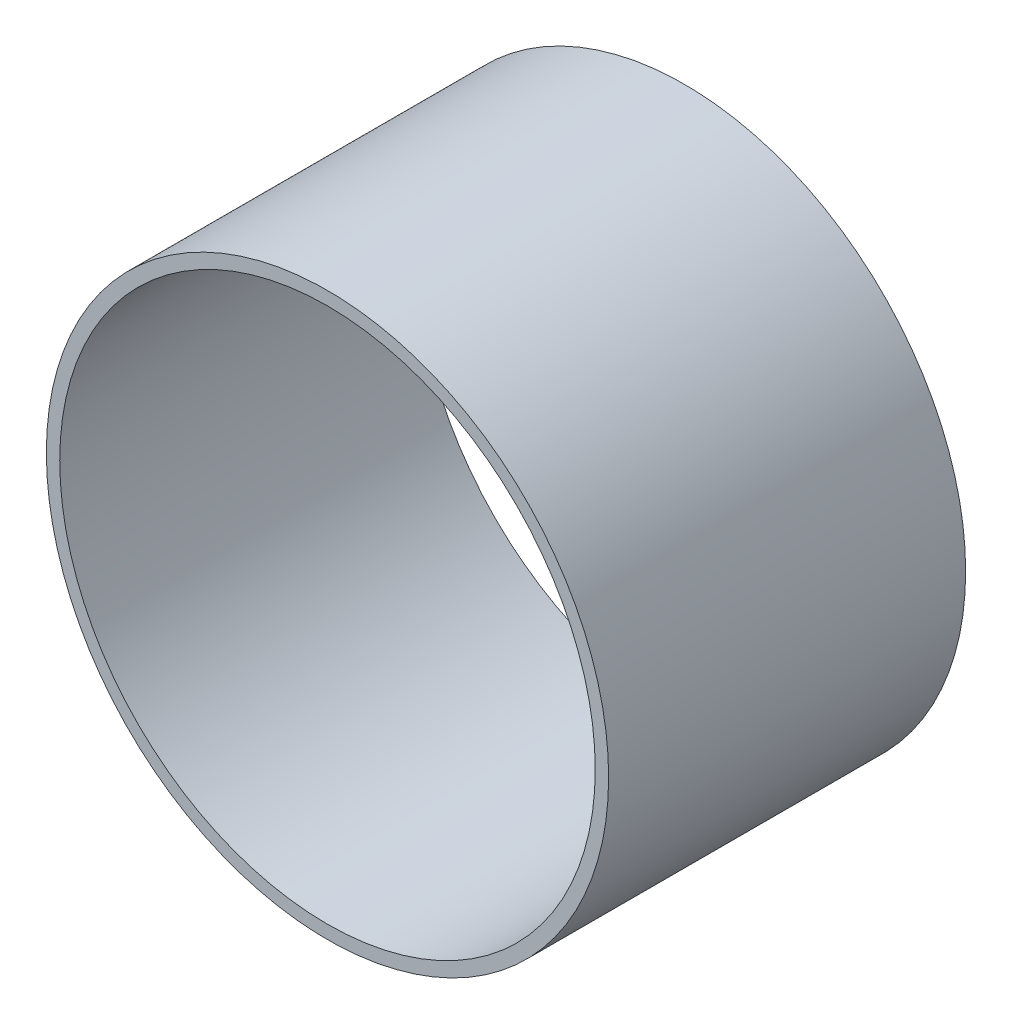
ISO-10303-21;
HEADER;
FILE_DESCRIPTION(('STEP AP214'),'2;1');
FILE_NAME('part.step','',(''),(''),'','','');
FILE_SCHEMA(('AUTOMOTIVE_DESIGN { 1 0 10303 214 1 1 1 1 }'));
ENDSEC;
DATA;
#1=APPLICATION_CONTEXT('core data for automotive mechanical design processes');
#2=APPLICATION_PROTOCOL_DEFINITION('international standard','automotive_design',2000,#1);
#3=PRODUCT_CONTEXT('',#1,'mechanical');
#4=PRODUCT('Part','Part','',(#3));
#5=PRODUCT_RELATED_PRODUCT_CATEGORY('part','',(#4));
#6=PRODUCT_DEFINITION_FORMATION('','',#4);
#7=PRODUCT_DEFINITION_CONTEXT('part definition',#1,'design');
#8=PRODUCT_DEFINITION('design','',#6,#7);
#9=PRODUCT_DEFINITION_SHAPE('','',#8);
#10=(LENGTH_UNIT() NAMED_UNIT(*) SI_UNIT(.MILLI.,.METRE.));
#11=(NAMED_UNIT(*) PLANE_ANGLE_UNIT() SI_UNIT($,.RADIAN.));
#12=(NAMED_UNIT(*) SI_UNIT($,.STERADIAN.) SOLID_ANGLE_UNIT());
#13=UNCERTAINTY_MEASURE_WITH_UNIT(LENGTH_MEASURE(1.E-05),#10,'distance_accuracy_value','');
#14=(GEOMETRIC_REPRESENTATION_CONTEXT(3) GLOBAL_UNCERTAINTY_ASSIGNED_CONTEXT((#13)) GLOBAL_UNIT_ASSIGNED_CONTEXT((#10,
#11,#12)) REPRESENTATION_CONTEXT('',''));
#15=CARTESIAN_POINT('',(0.,0.,0.));
#16=DIRECTION('',(0.,0.,1.));
#17=DIRECTION('',(1.,0.,0.));
#18=AXIS2_PLACEMENT_3D('',#15,#16,#17);
#19=CARTESIAN_POINT('',(0.,0.,20.));
#20=DIRECTION('',(0.,0.,1.));
#21=DIRECTION('',(1.,0.,0.));
#22=AXIS2_PLACEMENT_3D('',#19,#20,#21);
#23=PLANE('',#22);
#24=CARTESIAN_POINT('',(0.,0.,20.));
#25=DIRECTION('',(0.,0.,1.));
#26=DIRECTION('',(1.,0.,0.));
#27=AXIS2_PLACEMENT_3D('',#24,#25,#26);
#28=CIRCLE('',#27,15.75);
#29=CARTESIAN_POINT('',(15.75,0.,20.));
#30=VERTEX_POINT('',#29);
#31=EDGE_CURVE('E10',#30,#30,#28,.T.);
#32=ORIENTED_EDGE('',*,*,#31,.T.);
#33=EDGE_LOOP('',(#32));
#34=FACE_BOUND('',#33,.T.);
#35=CARTESIAN_POINT('',(0.,0.,20.));
#36=DIRECTION('',(0.,0.,1.));
#37=DIRECTION('',(1.,0.,0.));
#38=AXIS2_PLACEMENT_3D('',#35,#36,#37);
#39=CIRCLE('',#38,15.);
#40=CARTESIAN_POINT('',(15.,0.,20.));
#41=VERTEX_POINT('',#40);
#42=EDGE_CURVE('E42',#41,#41,#39,.T.);
#43=ORIENTED_EDGE('',*,*,#42,.F.);
#44=EDGE_LOOP('',(#43));
#45=FACE_BOUND('',#44,.T.);
#46=ADVANCED_FACE('F31',(#34,#45),#23,.T.);
#47=CARTESIAN_POINT('',(0.,0.,0.));
#48=DIRECTION('',(0.,0.,1.));
#49=DIRECTION('',(1.,0.,0.));
#50=AXIS2_PLACEMENT_3D('',#47,#48,#49);
#51=PLANE('',#50);
#52=CARTESIAN_POINT('',(0.,0.,0.));
#53=DIRECTION('',(0.,0.,1.));
#54=DIRECTION('',(1.,0.,0.));
#55=AXIS2_PLACEMENT_3D('',#52,#53,#54);
#56=CIRCLE('',#55,15.75);
#57=CARTESIAN_POINT('',(15.75,0.,0.));
#58=VERTEX_POINT('',#57);
#59=EDGE_CURVE('E38',#58,#58,#56,.T.);
#60=ORIENTED_EDGE('',*,*,#59,.F.);
#61=EDGE_LOOP('',(#60));
#62=FACE_BOUND('',#61,.T.);
#63=CARTESIAN_POINT('',(0.,0.,0.));
#64=DIRECTION('',(0.,0.,1.));
#65=DIRECTION('',(1.,0.,0.));
#66=AXIS2_PLACEMENT_3D('',#63,#64,#65);
#67=CIRCLE('',#66,15.);
#68=CARTESIAN_POINT('',(15.,0.,0.));
#69=VERTEX_POINT('',#68);
#70=EDGE_CURVE('E46',#69,#69,#67,.T.);
#71=ORIENTED_EDGE('',*,*,#70,.T.);
#72=EDGE_LOOP('',(#71));
#73=FACE_BOUND('',#72,.T.);
#74=ADVANCED_FACE('F52',(#62,#73),#51,.F.);
#75=CARTESIAN_POINT('',(0.,0.,20.));
#76=DIRECTION('',(0.,0.,-1.));
#77=DIRECTION('',(-1.,0.,0.));
#78=AXIS2_PLACEMENT_3D('',#75,#76,#77);
#79=CYLINDRICAL_SURFACE('',#78,15.75);
#80=ORIENTED_EDGE('',*,*,#31,.F.);
#81=EDGE_LOOP('',(#80));
#82=FACE_BOUND('',#81,.T.);
#83=ORIENTED_EDGE('',*,*,#59,.T.);
#84=EDGE_LOOP('',(#83));
#85=FACE_BOUND('',#84,.T.);
#86=ADVANCED_FACE('F33',(#82,#85),#79,.T.);
#87=CARTESIAN_POINT('',(0.,0.,20.));
#88=DIRECTION('',(0.,0.,-1.));
#89=DIRECTION('',(-1.,0.,0.));
#90=AXIS2_PLACEMENT_3D('',#87,#88,#89);
#91=CYLINDRICAL_SURFACE('',#90,15.);
#92=ORIENTED_EDGE('',*,*,#42,.T.);
#93=EDGE_LOOP('',(#92));
#94=FACE_BOUND('',#93,.T.);
#95=ORIENTED_EDGE('',*,*,#70,.F.);
#96=EDGE_LOOP('',(#95));
#97=FACE_BOUND('',#96,.T.);
#98=ADVANCED_FACE('F54',(#94,#97),#91,.F.);
#99=CLOSED_SHELL('',(#46,#74,#86,#98));
#100=MANIFOLD_SOLID_BREP('B2',#99);
#101=ADVANCED_BREP_SHAPE_REPRESENTATION('',(#18,#100),#14);
#102=SHAPE_DEFINITION_REPRESENTATION(#9,#101);
ENDSEC;
END-ISO-10303-21;
